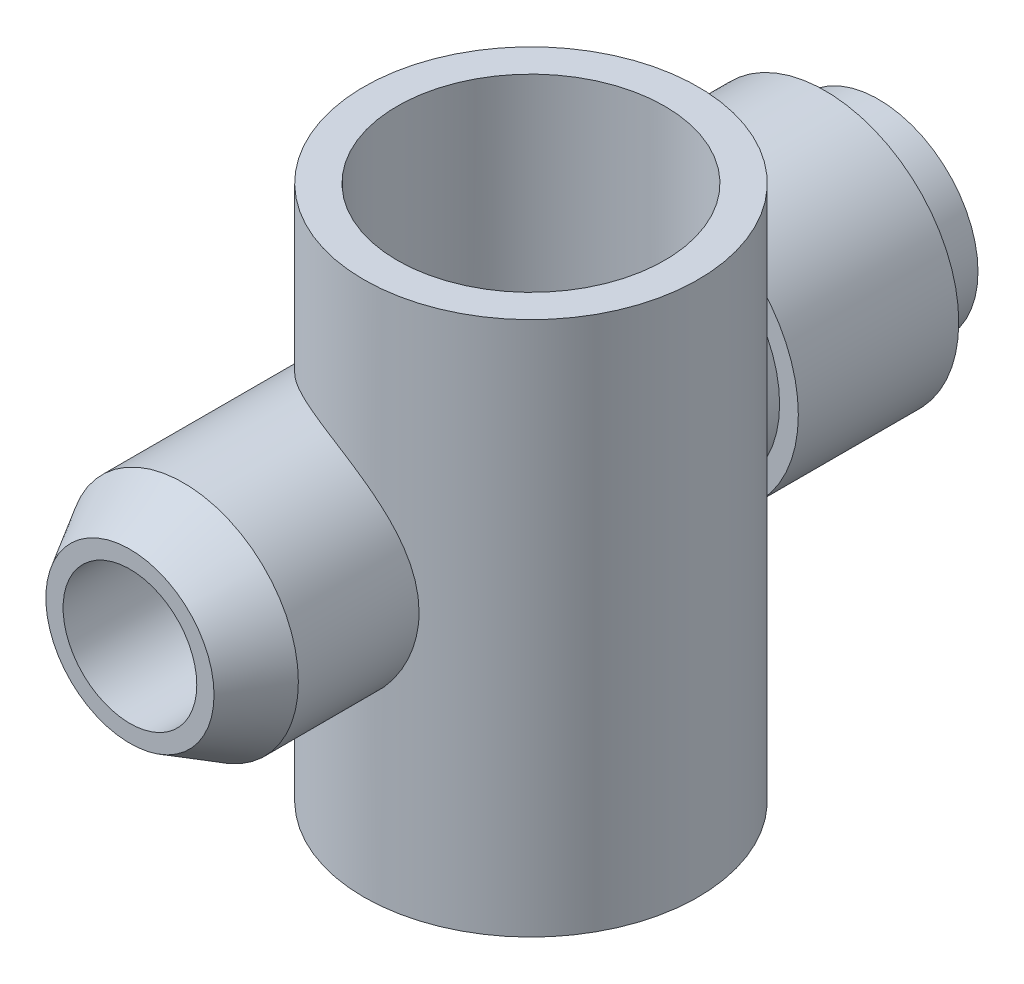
from build123d import *

# Parameters (mm, degrees)
SKETCH1_R           = 4.7244
INSET_DEPTH         = 2.54
SKETCH2_R           = 6.35
BASE_DEPTH          = 7.62
SKETCH3_R           = 5.461
NIB_DEPTH           = 25.4
EXTRUDE5_DEPTH      = 12.7
EXTRUDE5_DEPTH_BACK = 12.7
SKETCH5_R           = 7.9375
SKETCH6_R           = 6.35
CUT_EXTRUDE2_DEPTH  = 22.86
SKETCH4_R           = 3.175
CUT_EXTRUDE1_DEPTH  = 40.361037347
CHAMFER1_SIZE       = 2.54
CHAMFER1_SIZE2      = 1.466469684


with BuildPart() as part:
    # Sketch1 → inset (new body)
    with BuildSketch(Plane.XY):
        Circle(SKETCH1_R)
    extrude(amount=INSET_DEPTH)

    # Sketch2 → base (add)
    with BuildSketch(Plane.XY.offset(2.54)):
        with Locations(Location((0, 0, 0), (0, 0, 180))):
            Circle(SKETCH2_R)
    extrude(amount=BASE_DEPTH)

    # Sketch3 → nib (add)
    with BuildSketch(Plane.XY.offset(10.16)):
        Circle(SKETCH3_R)
    extrude(amount=NIB_DEPTH)

    # Sketch5 → Extrude5 (add, two sides: drawn at the far end of the back side and taken through both)
    with BuildSketch(Plane(origin=(0, 0, 0), x_dir=(1, 0, 0), z_dir=(0, 1, 0)).offset(-EXTRUDE5_DEPTH_BACK)):
        with Locations(Location((3.175, -19.685, 0), (0, 0, 270))):
            Circle(SKETCH5_R)
    extrude(amount=EXTRUDE5_DEPTH + EXTRUDE5_DEPTH_BACK)

    # Sketch6 → Cut-Extrude2 (cut)
    with BuildSketch(Plane(origin=(0, 12.7, 0), x_dir=(1, 0, 0), z_dir=(0, 1, 0))):
        with Locations(Location((3.175, -19.685, 0), (0, 0, 270))):
            Circle(SKETCH6_R)
    extrude(amount=-CUT_EXTRUDE2_DEPTH, mode=Mode.SUBTRACT)

    # Sketch4 → Cut-Extrude1 (cut, through all)
    with BuildSketch(Plane.XY.offset(35.56)):
        Circle(SKETCH4_R)
    extrude(amount=-CUT_EXTRUDE1_DEPTH, mode=Mode.SUBTRACT)

    # Chamfer1
    chamfer1_edges = [part.edges().sort_by_distance(p)[0] for p in [
        (-5.461, 0, 35.56),
    ]]
    chamfer1_side = [part.faces().sort_by_distance(p)[0] for p in [
        (-5.461, 0, 22.86),
    ]]
    chamfer(chamfer1_edges, length=CHAMFER1_SIZE, length2=CHAMFER1_SIZE2, reference=chamfer1_side[0])


solid = part.part
